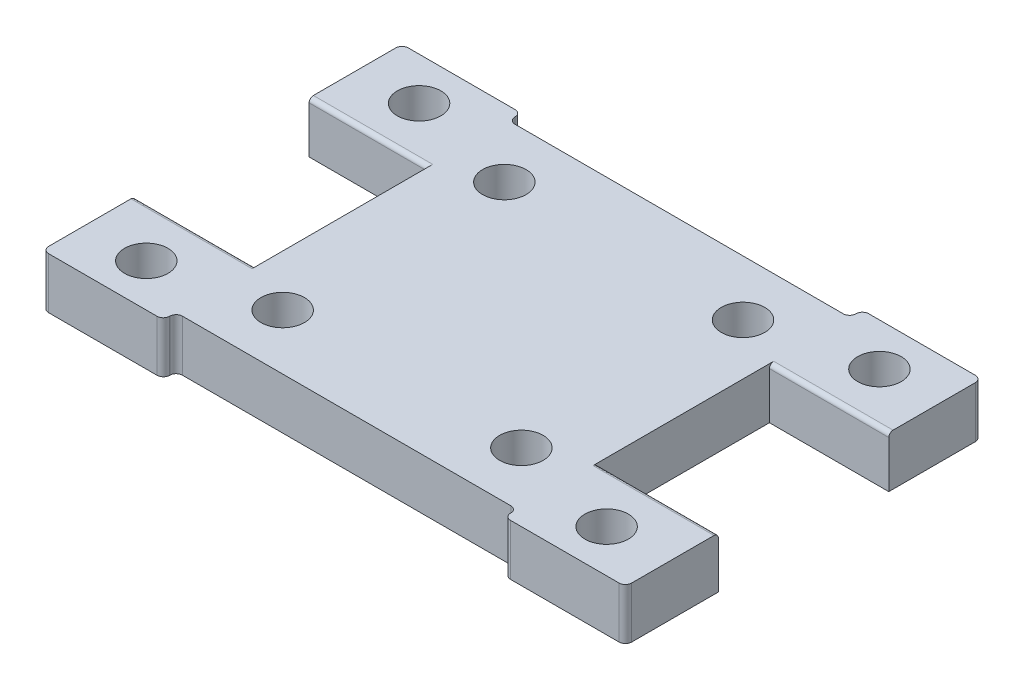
ISO-10303-21;
HEADER;
FILE_DESCRIPTION(('STEP AP214'),'2;1');
FILE_NAME('part.step','',(''),(''),'','','');
FILE_SCHEMA(('AUTOMOTIVE_DESIGN { 1 0 10303 214 1 1 1 1 }'));
ENDSEC;
DATA;
#1=APPLICATION_CONTEXT('core data for automotive mechanical design processes');
#2=APPLICATION_PROTOCOL_DEFINITION('international standard','automotive_design',2000,#1);
#3=PRODUCT_CONTEXT('',#1,'mechanical');
#4=PRODUCT('Part','Part','',(#3));
#5=PRODUCT_RELATED_PRODUCT_CATEGORY('part','',(#4));
#6=PRODUCT_DEFINITION_FORMATION('','',#4);
#7=PRODUCT_DEFINITION_CONTEXT('part definition',#1,'design');
#8=PRODUCT_DEFINITION('design','',#6,#7);
#9=PRODUCT_DEFINITION_SHAPE('','',#8);
#10=(LENGTH_UNIT() NAMED_UNIT(*) SI_UNIT(.MILLI.,.METRE.));
#11=(NAMED_UNIT(*) PLANE_ANGLE_UNIT() SI_UNIT($,.RADIAN.));
#12=(NAMED_UNIT(*) SI_UNIT($,.STERADIAN.) SOLID_ANGLE_UNIT());
#13=UNCERTAINTY_MEASURE_WITH_UNIT(LENGTH_MEASURE(1.E-05),#10,'distance_accuracy_value','');
#14=(GEOMETRIC_REPRESENTATION_CONTEXT(3) GLOBAL_UNCERTAINTY_ASSIGNED_CONTEXT((#13)) GLOBAL_UNIT_ASSIGNED_CONTEXT((#10,
#11,#12)) REPRESENTATION_CONTEXT('',''));
#15=CARTESIAN_POINT('',(0.,0.,0.));
#16=DIRECTION('',(0.,0.,1.));
#17=DIRECTION('',(1.,0.,0.));
#18=AXIS2_PLACEMENT_3D('',#15,#16,#17);
#19=CARTESIAN_POINT('',(20.74,6.,-20.26));
#20=DIRECTION('',(0.,-1.,0.));
#21=DIRECTION('',(0.,0.,-1.));
#22=AXIS2_PLACEMENT_3D('',#19,#20,#21);
#23=PLANE('',#22);
#24=DIRECTION('',(0.,0.,1.));
#25=VECTOR('',#24,1.);
#26=CARTESIAN_POINT('',(-34.,6.,-10.1));
#27=LINE('',#26,#25);
#28=CARTESIAN_POINT('',(-34.,6.,-20.26));
#29=VERTEX_POINT('',#28);
#30=CARTESIAN_POINT('',(-34.,6.,-10.6));
#31=VERTEX_POINT('',#30);
#32=EDGE_CURVE('E314',#29,#31,#27,.T.);
#33=ORIENTED_EDGE('',*,*,#32,.T.);
#34=DIRECTION('',(1.,0.,0.));
#35=VECTOR('',#34,1.);
#36=CARTESIAN_POINT('',(20.74,6.,-10.6));
#37=LINE('',#36,#35);
#38=CARTESIAN_POINT('',(-20.,6.,-10.6));
#39=VERTEX_POINT('',#38);
#40=EDGE_CURVE('E514',#31,#39,#37,.T.);
#41=ORIENTED_EDGE('',*,*,#40,.T.);
#42=DIRECTION('',(0.,0.,1.));
#43=VECTOR('',#42,1.);
#44=CARTESIAN_POINT('',(-20.,6.,10.0990098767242));
#45=LINE('',#44,#43);
#46=CARTESIAN_POINT('',(-20.,6.,10.5990098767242));
#47=VERTEX_POINT('',#46);
#48=EDGE_CURVE('E316',#39,#47,#45,.T.);
#49=ORIENTED_EDGE('',*,*,#48,.T.);
#50=DIRECTION('',(-1.,0.,0.));
#51=VECTOR('',#50,1.);
#52=CARTESIAN_POINT('',(20.74,6.,10.5990098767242));
#53=LINE('',#52,#51);
#54=CARTESIAN_POINT('',(-34.2,6.,10.5990098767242));
#55=VERTEX_POINT('',#54);
#56=EDGE_CURVE('E511',#47,#55,#53,.T.);
#57=ORIENTED_EDGE('',*,*,#56,.T.);
#58=DIRECTION('',(0.,0.,1.));
#59=VECTOR('',#58,1.);
#60=CARTESIAN_POINT('',(-34.2,6.,10.0990098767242));
#61=LINE('',#60,#59);
#62=CARTESIAN_POINT('',(-34.2,6.,20.26));
#63=VERTEX_POINT('',#62);
#64=EDGE_CURVE('E318',#55,#63,#61,.T.);
#65=ORIENTED_EDGE('',*,*,#64,.T.);
#66=CARTESIAN_POINT('',(-33.46,6.,20.26));
#67=DIRECTION('',(0.,-1.,0.));
#68=DIRECTION('',(0.,0.,-1.));
#69=AXIS2_PLACEMENT_3D('',#66,#67,#68);
#70=CIRCLE('',#69,0.74);
#71=CARTESIAN_POINT('',(-33.46,6.,21.));
#72=VERTEX_POINT('',#71);
#73=EDGE_CURVE('E485',#63,#72,#70,.F.);
#74=ORIENTED_EDGE('',*,*,#73,.T.);
#75=DIRECTION('',(1.,0.,0.));
#76=VECTOR('',#75,1.);
#77=CARTESIAN_POINT('',(-34.2,6.,21.));
#78=LINE('',#77,#76);
#79=CARTESIAN_POINT('',(-20.74,6.,21.));
#80=VERTEX_POINT('',#79);
#81=EDGE_CURVE('E320',#72,#80,#78,.T.);
#82=ORIENTED_EDGE('',*,*,#81,.T.);
#83=CARTESIAN_POINT('',(-20.74,6.,20.26));
#84=DIRECTION('',(0.,1.,0.));
#85=DIRECTION('',(0.,0.,-1.));
#86=AXIS2_PLACEMENT_3D('',#83,#84,#85);
#87=CIRCLE('',#86,0.739999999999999);
#88=CARTESIAN_POINT('',(-20.,6.,20.26));
#89=VERTEX_POINT('',#88);
#90=EDGE_CURVE('E322',#80,#89,#87,.T.);
#91=ORIENTED_EDGE('',*,*,#90,.T.);
#92=DIRECTION('',(0.,0.,-1.));
#93=VECTOR('',#92,1.);
#94=CARTESIAN_POINT('',(-20.,6.,20.26));
#95=LINE('',#94,#93);
#96=CARTESIAN_POINT('',(-20.,6.,20.24));
#97=VERTEX_POINT('',#96);
#98=EDGE_CURVE('E324',#89,#97,#95,.T.);
#99=ORIENTED_EDGE('',*,*,#98,.T.);
#100=CARTESIAN_POINT('',(-19.26,6.,20.24));
#101=DIRECTION('',(0.,-1.,0.));
#102=DIRECTION('',(0.,0.,1.));
#103=AXIS2_PLACEMENT_3D('',#100,#101,#102);
#104=CIRCLE('',#103,0.740000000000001);
#105=CARTESIAN_POINT('',(-19.26,6.,19.5));
#106=VERTEX_POINT('',#105);
#107=EDGE_CURVE('E326',#97,#106,#104,.T.);
#108=ORIENTED_EDGE('',*,*,#107,.T.);
#109=DIRECTION('',(1.,0.,0.));
#110=VECTOR('',#109,1.);
#111=CARTESIAN_POINT('',(-19.26,6.,19.5));
#112=LINE('',#111,#110);
#113=CARTESIAN_POINT('',(19.26,6.,19.5));
#114=VERTEX_POINT('',#113);
#115=EDGE_CURVE('E328',#106,#114,#112,.T.);
#116=ORIENTED_EDGE('',*,*,#115,.T.);
#117=CARTESIAN_POINT('',(19.26,6.,20.24));
#118=DIRECTION('',(0.,-1.,0.));
#119=DIRECTION('',(0.,0.,-1.));
#120=AXIS2_PLACEMENT_3D('',#117,#118,#119);
#121=CIRCLE('',#120,0.740000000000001);
#122=CARTESIAN_POINT('',(20.,6.,20.24));
#123=VERTEX_POINT('',#122);
#124=EDGE_CURVE('E330',#114,#123,#121,.T.);
#125=ORIENTED_EDGE('',*,*,#124,.T.);
#126=DIRECTION('',(0.,0.,1.));
#127=VECTOR('',#126,1.);
#128=CARTESIAN_POINT('',(20.,6.,20.26));
#129=LINE('',#128,#127);
#130=CARTESIAN_POINT('',(20.,6.,20.26));
#131=VERTEX_POINT('',#130);
#132=EDGE_CURVE('E332',#123,#131,#129,.T.);
#133=ORIENTED_EDGE('',*,*,#132,.T.);
#134=CARTESIAN_POINT('',(20.74,6.,20.26));
#135=DIRECTION('',(0.,1.,0.));
#136=DIRECTION('',(0.,0.,-1.));
#137=AXIS2_PLACEMENT_3D('',#134,#135,#136);
#138=CIRCLE('',#137,0.740000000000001);
#139=CARTESIAN_POINT('',(20.74,6.,21.));
#140=VERTEX_POINT('',#139);
#141=EDGE_CURVE('E334',#131,#140,#138,.T.);
#142=ORIENTED_EDGE('',*,*,#141,.T.);
#143=DIRECTION('',(1.,0.,0.));
#144=VECTOR('',#143,1.);
#145=CARTESIAN_POINT('',(34.2,6.,21.));
#146=LINE('',#145,#144);
#147=CARTESIAN_POINT('',(33.46,6.,21.));
#148=VERTEX_POINT('',#147);
#149=EDGE_CURVE('E336',#140,#148,#146,.T.);
#150=ORIENTED_EDGE('',*,*,#149,.T.);
#151=CARTESIAN_POINT('',(33.46,6.,20.26));
#152=DIRECTION('',(0.,-1.,0.));
#153=DIRECTION('',(0.,0.,-1.));
#154=AXIS2_PLACEMENT_3D('',#151,#152,#153);
#155=CIRCLE('',#154,0.74);
#156=CARTESIAN_POINT('',(34.2,6.,20.26));
#157=VERTEX_POINT('',#156);
#158=EDGE_CURVE('E483',#148,#157,#155,.F.);
#159=ORIENTED_EDGE('',*,*,#158,.T.);
#160=DIRECTION('',(0.,0.,-1.));
#161=VECTOR('',#160,1.);
#162=CARTESIAN_POINT('',(34.2,6.,10.0990098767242));
#163=LINE('',#162,#161);
#164=CARTESIAN_POINT('',(34.2,6.,10.5990098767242));
#165=VERTEX_POINT('',#164);
#166=EDGE_CURVE('E339',#157,#165,#163,.T.);
#167=ORIENTED_EDGE('',*,*,#166,.T.);
#168=DIRECTION('',(-1.,0.,0.));
#169=VECTOR('',#168,1.);
#170=CARTESIAN_POINT('',(20.74,6.,10.5990098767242));
#171=LINE('',#170,#169);
#172=CARTESIAN_POINT('',(20.,6.,10.5990098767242));
#173=VERTEX_POINT('',#172);
#174=EDGE_CURVE('E505',#165,#173,#171,.T.);
#175=ORIENTED_EDGE('',*,*,#174,.T.);
#176=DIRECTION('',(0.,0.,-1.));
#177=VECTOR('',#176,1.);
#178=CARTESIAN_POINT('',(20.,6.,10.0990098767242));
#179=LINE('',#178,#177);
#180=CARTESIAN_POINT('',(20.,6.,-10.6));
#181=VERTEX_POINT('',#180);
#182=EDGE_CURVE('E411',#173,#181,#179,.T.);
#183=ORIENTED_EDGE('',*,*,#182,.T.);
#184=DIRECTION('',(1.,0.,0.));
#185=VECTOR('',#184,1.);
#186=CARTESIAN_POINT('',(20.74,6.,-10.6));
#187=LINE('',#186,#185);
#188=CARTESIAN_POINT('',(34.,6.,-10.6));
#189=VERTEX_POINT('',#188);
#190=EDGE_CURVE('E508',#181,#189,#187,.T.);
#191=ORIENTED_EDGE('',*,*,#190,.T.);
#192=DIRECTION('',(0.,0.,-1.));
#193=VECTOR('',#192,1.);
#194=CARTESIAN_POINT('',(34.,6.,-10.1));
#195=LINE('',#194,#193);
#196=CARTESIAN_POINT('',(34.,6.,-20.26));
#197=VERTEX_POINT('',#196);
#198=EDGE_CURVE('E281',#189,#197,#195,.T.);
#199=ORIENTED_EDGE('',*,*,#198,.T.);
#200=CARTESIAN_POINT('',(33.26,6.,-20.26));
#201=DIRECTION('',(0.,-1.,0.));
#202=DIRECTION('',(0.,0.,-1.));
#203=AXIS2_PLACEMENT_3D('',#200,#201,#202);
#204=CIRCLE('',#203,0.74);
#205=CARTESIAN_POINT('',(33.26,6.,-21.));
#206=VERTEX_POINT('',#205);
#207=EDGE_CURVE('E277',#197,#206,#204,.F.);
#208=ORIENTED_EDGE('',*,*,#207,.T.);
#209=DIRECTION('',(-1.,0.,0.));
#210=VECTOR('',#209,1.);
#211=CARTESIAN_POINT('',(20.74,6.,-21.));
#212=LINE('',#211,#210);
#213=CARTESIAN_POINT('',(20.74,6.,-21.));
#214=VERTEX_POINT('',#213);
#215=EDGE_CURVE('E269',#206,#214,#212,.T.);
#216=ORIENTED_EDGE('',*,*,#215,.T.);
#217=CARTESIAN_POINT('',(20.74,6.,-20.26));
#218=DIRECTION('',(0.,1.,0.));
#219=DIRECTION('',(0.,0.,-1.));
#220=AXIS2_PLACEMENT_3D('',#217,#218,#219);
#221=CIRCLE('',#220,0.740000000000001);
#222=CARTESIAN_POINT('',(20.,6.,-20.26));
#223=VERTEX_POINT('',#222);
#224=EDGE_CURVE('E274',#214,#223,#221,.T.);
#225=ORIENTED_EDGE('',*,*,#224,.T.);
#226=DIRECTION('',(0.,0.,1.));
#227=VECTOR('',#226,1.);
#228=CARTESIAN_POINT('',(20.,6.,-20.24));
#229=LINE('',#228,#227);
#230=CARTESIAN_POINT('',(20.,6.,-20.24));
#231=VERTEX_POINT('',#230);
#232=EDGE_CURVE('E296',#223,#231,#229,.T.);
#233=ORIENTED_EDGE('',*,*,#232,.T.);
#234=CARTESIAN_POINT('',(19.26,6.,-20.24));
#235=DIRECTION('',(0.,-1.,0.));
#236=DIRECTION('',(0.,0.,1.));
#237=AXIS2_PLACEMENT_3D('',#234,#235,#236);
#238=CIRCLE('',#237,0.740000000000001);
#239=CARTESIAN_POINT('',(19.26,6.,-19.5));
#240=VERTEX_POINT('',#239);
#241=EDGE_CURVE('E298',#231,#240,#238,.T.);
#242=ORIENTED_EDGE('',*,*,#241,.T.);
#243=DIRECTION('',(-1.,0.,0.));
#244=VECTOR('',#243,1.);
#245=CARTESIAN_POINT('',(-19.26,6.,-19.5));
#246=LINE('',#245,#244);
#247=CARTESIAN_POINT('',(-19.26,6.,-19.5));
#248=VERTEX_POINT('',#247);
#249=EDGE_CURVE('E303',#240,#248,#246,.T.);
#250=ORIENTED_EDGE('',*,*,#249,.T.);
#251=CARTESIAN_POINT('',(-19.26,6.,-20.24));
#252=DIRECTION('',(0.,-1.,0.));
#253=DIRECTION('',(0.,0.,1.));
#254=AXIS2_PLACEMENT_3D('',#251,#252,#253);
#255=CIRCLE('',#254,0.740000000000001);
#256=CARTESIAN_POINT('',(-20.,6.,-20.24));
#257=VERTEX_POINT('',#256);
#258=EDGE_CURVE('E305',#248,#257,#255,.T.);
#259=ORIENTED_EDGE('',*,*,#258,.T.);
#260=DIRECTION('',(0.,0.,-1.));
#261=VECTOR('',#260,1.);
#262=CARTESIAN_POINT('',(-20.,6.,-20.24));
#263=LINE('',#262,#261);
#264=CARTESIAN_POINT('',(-20.,6.,-20.26));
#265=VERTEX_POINT('',#264);
#266=EDGE_CURVE('E307',#257,#265,#263,.T.);
#267=ORIENTED_EDGE('',*,*,#266,.T.);
#268=CARTESIAN_POINT('',(-20.74,6.,-20.26));
#269=DIRECTION('',(0.,1.,0.));
#270=DIRECTION('',(0.,0.,-1.));
#271=AXIS2_PLACEMENT_3D('',#268,#269,#270);
#272=CIRCLE('',#271,0.740000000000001);
#273=CARTESIAN_POINT('',(-20.74,6.,-21.));
#274=VERTEX_POINT('',#273);
#275=EDGE_CURVE('E309',#265,#274,#272,.T.);
#276=ORIENTED_EDGE('',*,*,#275,.T.);
#277=DIRECTION('',(-1.,0.,0.));
#278=VECTOR('',#277,1.);
#279=CARTESIAN_POINT('',(-20.74,6.,-21.));
#280=LINE('',#279,#278);
#281=CARTESIAN_POINT('',(-33.26,6.,-21.));
#282=VERTEX_POINT('',#281);
#283=EDGE_CURVE('E311',#274,#282,#280,.T.);
#284=ORIENTED_EDGE('',*,*,#283,.T.);
#285=CARTESIAN_POINT('',(-33.26,6.,-20.26));
#286=DIRECTION('',(0.,-1.,0.));
#287=DIRECTION('',(0.,0.,-1.));
#288=AXIS2_PLACEMENT_3D('',#285,#286,#287);
#289=CIRCLE('',#288,0.74);
#290=EDGE_CURVE('E487',#282,#29,#289,.F.);
#291=ORIENTED_EDGE('',*,*,#290,.T.);
#292=EDGE_LOOP('',(#33,#41,#49,#57,#65,#74,#82,#91,#99,#108,#116,#125,#133,#142,#150,#159,#167,
#175,#183,#191,#199,#208,#216,#225,#233,#242,#250,#259,#267,#276,#284,#291));
#293=FACE_BOUND('',#292,.T.);
#294=CARTESIAN_POINT('',(-14.,6.,-13.));
#295=DIRECTION('',(0.,1.,0.));
#296=DIRECTION('',(0.,0.,1.));
#297=AXIS2_PLACEMENT_3D('',#294,#295,#296);
#298=CIRCLE('',#297,2.55);
#299=CARTESIAN_POINT('',(-14.,6.,-10.45));
#300=VERTEX_POINT('',#299);
#301=EDGE_CURVE('E347',#300,#300,#298,.T.);
#302=ORIENTED_EDGE('',*,*,#301,.F.);
#303=EDGE_LOOP('',(#302));
#304=FACE_BOUND('',#303,.T.);
#305=CARTESIAN_POINT('',(27.,6.,-16.));
#306=DIRECTION('',(0.,1.,0.));
#307=DIRECTION('',(0.,0.,1.));
#308=AXIS2_PLACEMENT_3D('',#305,#306,#307);
#309=CIRCLE('',#308,2.55);
#310=CARTESIAN_POINT('',(27.,6.,-13.45));
#311=VERTEX_POINT('',#310);
#312=EDGE_CURVE('E554',#311,#311,#309,.T.);
#313=ORIENTED_EDGE('',*,*,#312,.F.);
#314=EDGE_LOOP('',(#313));
#315=FACE_BOUND('',#314,.T.);
#316=CARTESIAN_POINT('',(14.,6.,-13.));
#317=DIRECTION('',(0.,1.,0.));
#318=DIRECTION('',(0.,0.,-1.));
#319=AXIS2_PLACEMENT_3D('',#316,#317,#318);
#320=CIRCLE('',#319,2.55);
#321=CARTESIAN_POINT('',(14.,6.,-15.55));
#322=VERTEX_POINT('',#321);
#323=EDGE_CURVE('E560',#322,#322,#320,.T.);
#324=ORIENTED_EDGE('',*,*,#323,.F.);
#325=EDGE_LOOP('',(#324));
#326=FACE_BOUND('',#325,.T.);
#327=CARTESIAN_POINT('',(14.,6.,13.));
#328=DIRECTION('',(0.,1.,0.));
#329=DIRECTION('',(0.,0.,1.));
#330=AXIS2_PLACEMENT_3D('',#327,#328,#329);
#331=CIRCLE('',#330,2.55);
#332=CARTESIAN_POINT('',(14.,6.,15.55));
#333=VERTEX_POINT('',#332);
#334=EDGE_CURVE('E566',#333,#333,#331,.T.);
#335=ORIENTED_EDGE('',*,*,#334,.F.);
#336=EDGE_LOOP('',(#335));
#337=FACE_BOUND('',#336,.T.);
#338=CARTESIAN_POINT('',(-14.,6.,13.));
#339=DIRECTION('',(0.,1.,0.));
#340=DIRECTION('',(0.,0.,-1.));
#341=AXIS2_PLACEMENT_3D('',#338,#339,#340);
#342=CIRCLE('',#341,2.55);
#343=CARTESIAN_POINT('',(-14.,6.,10.45));
#344=VERTEX_POINT('',#343);
#345=EDGE_CURVE('E572',#344,#344,#342,.T.);
#346=ORIENTED_EDGE('',*,*,#345,.F.);
#347=EDGE_LOOP('',(#346));
#348=FACE_BOUND('',#347,.T.);
#349=CARTESIAN_POINT('',(27.,6.,16.));
#350=DIRECTION('',(0.,1.,0.));
#351=DIRECTION('',(0.,0.,-1.));
#352=AXIS2_PLACEMENT_3D('',#349,#350,#351);
#353=CIRCLE('',#352,2.55);
#354=CARTESIAN_POINT('',(27.,6.,13.45));
#355=VERTEX_POINT('',#354);
#356=EDGE_CURVE('E578',#355,#355,#353,.T.);
#357=ORIENTED_EDGE('',*,*,#356,.F.);
#358=EDGE_LOOP('',(#357));
#359=FACE_BOUND('',#358,.T.);
#360=CARTESIAN_POINT('',(-27.,6.,16.));
#361=DIRECTION('',(0.,1.,0.));
#362=DIRECTION('',(0.,0.,1.));
#363=AXIS2_PLACEMENT_3D('',#360,#361,#362);
#364=CIRCLE('',#363,2.55);
#365=CARTESIAN_POINT('',(-27.,6.,18.55));
#366=VERTEX_POINT('',#365);
#367=EDGE_CURVE('E584',#366,#366,#364,.T.);
#368=ORIENTED_EDGE('',*,*,#367,.F.);
#369=EDGE_LOOP('',(#368));
#370=FACE_BOUND('',#369,.T.);
#371=CARTESIAN_POINT('',(-27.,6.,-16.));
#372=DIRECTION('',(0.,1.,0.));
#373=DIRECTION('',(0.,0.,-1.));
#374=AXIS2_PLACEMENT_3D('',#371,#372,#373);
#375=CIRCLE('',#374,2.55);
#376=CARTESIAN_POINT('',(-27.,6.,-18.55));
#377=VERTEX_POINT('',#376);
#378=EDGE_CURVE('E590',#377,#377,#375,.T.);
#379=ORIENTED_EDGE('',*,*,#378,.F.);
#380=EDGE_LOOP('',(#379));
#381=FACE_BOUND('',#380,.T.);
#382=ADVANCED_FACE('F39',(#293,#304,#315,#326,#337,#348,#359,#370,#381),#23,.F.);
#383=CARTESIAN_POINT('',(20.74,0.,-20.26));
#384=DIRECTION('',(0.,-1.,0.));
#385=DIRECTION('',(0.,0.,-1.));
#386=AXIS2_PLACEMENT_3D('',#383,#384,#385);
#387=PLANE('',#386);
#388=CARTESIAN_POINT('',(-27.,0.,16.));
#389=DIRECTION('',(0.,1.,0.));
#390=DIRECTION('',(0.,0.,1.));
#391=AXIS2_PLACEMENT_3D('',#388,#389,#390);
#392=CIRCLE('',#391,2.55);
#393=CARTESIAN_POINT('',(-27.,0.,18.55));
#394=VERTEX_POINT('',#393);
#395=EDGE_CURVE('E587',#394,#394,#392,.T.);
#396=ORIENTED_EDGE('',*,*,#395,.T.);
#397=EDGE_LOOP('',(#396));
#398=FACE_BOUND('',#397,.T.);
#399=CARTESIAN_POINT('',(-14.,0.,13.));
#400=DIRECTION('',(0.,1.,0.));
#401=DIRECTION('',(0.,0.,-1.));
#402=AXIS2_PLACEMENT_3D('',#399,#400,#401);
#403=CIRCLE('',#402,2.55);
#404=CARTESIAN_POINT('',(-14.,0.,10.45));
#405=VERTEX_POINT('',#404);
#406=EDGE_CURVE('E575',#405,#405,#403,.T.);
#407=ORIENTED_EDGE('',*,*,#406,.T.);
#408=EDGE_LOOP('',(#407));
#409=FACE_BOUND('',#408,.T.);
#410=CARTESIAN_POINT('',(14.,0.,-13.));
#411=DIRECTION('',(0.,1.,0.));
#412=DIRECTION('',(0.,0.,-1.));
#413=AXIS2_PLACEMENT_3D('',#410,#411,#412);
#414=CIRCLE('',#413,2.55);
#415=CARTESIAN_POINT('',(14.,0.,-15.55));
#416=VERTEX_POINT('',#415);
#417=EDGE_CURVE('E563',#416,#416,#414,.T.);
#418=ORIENTED_EDGE('',*,*,#417,.T.);
#419=EDGE_LOOP('',(#418));
#420=FACE_BOUND('',#419,.T.);
#421=CARTESIAN_POINT('',(-14.,0.,-13.));
#422=DIRECTION('',(0.,1.,0.));
#423=DIRECTION('',(0.,0.,1.));
#424=AXIS2_PLACEMENT_3D('',#421,#422,#423);
#425=CIRCLE('',#424,2.55);
#426=CARTESIAN_POINT('',(-14.,0.,-10.45));
#427=VERTEX_POINT('',#426);
#428=EDGE_CURVE('E551',#427,#427,#425,.T.);
#429=ORIENTED_EDGE('',*,*,#428,.T.);
#430=EDGE_LOOP('',(#429));
#431=FACE_BOUND('',#430,.T.);
#432=DIRECTION('',(0.,0.,1.));
#433=VECTOR('',#432,1.);
#434=CARTESIAN_POINT('',(-34.,0.,-10.1));
#435=LINE('',#434,#433);
#436=CARTESIAN_POINT('',(-34.,0.,-20.26));
#437=VERTEX_POINT('',#436);
#438=CARTESIAN_POINT('',(-34.,0.,-10.1));
#439=VERTEX_POINT('',#438);
#440=EDGE_CURVE('E371',#437,#439,#435,.T.);
#441=ORIENTED_EDGE('',*,*,#440,.F.);
#442=CARTESIAN_POINT('',(-33.26,0.,-20.26));
#443=DIRECTION('',(0.,-1.,0.));
#444=DIRECTION('',(0.,0.,-1.));
#445=AXIS2_PLACEMENT_3D('',#442,#443,#444);
#446=CIRCLE('',#445,0.74);
#447=CARTESIAN_POINT('',(-33.26,0.,-21.));
#448=VERTEX_POINT('',#447);
#449=EDGE_CURVE('E478',#437,#448,#446,.T.);
#450=ORIENTED_EDGE('',*,*,#449,.T.);
#451=DIRECTION('',(-1.,0.,0.));
#452=VECTOR('',#451,1.);
#453=CARTESIAN_POINT('',(-20.74,0.,-21.));
#454=LINE('',#453,#452);
#455=CARTESIAN_POINT('',(-20.74,0.,-21.));
#456=VERTEX_POINT('',#455);
#457=EDGE_CURVE('E368',#456,#448,#454,.T.);
#458=ORIENTED_EDGE('',*,*,#457,.F.);
#459=CARTESIAN_POINT('',(-20.74,0.,-20.26));
#460=DIRECTION('',(0.,1.,0.));
#461=DIRECTION('',(0.,0.,-1.));
#462=AXIS2_PLACEMENT_3D('',#459,#460,#461);
#463=CIRCLE('',#462,0.740000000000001);
#464=CARTESIAN_POINT('',(-20.,0.,-20.26));
#465=VERTEX_POINT('',#464);
#466=EDGE_CURVE('E366',#465,#456,#463,.T.);
#467=ORIENTED_EDGE('',*,*,#466,.F.);
#468=DIRECTION('',(0.,0.,-1.));
#469=VECTOR('',#468,1.);
#470=CARTESIAN_POINT('',(-20.,0.,-20.24));
#471=LINE('',#470,#469);
#472=CARTESIAN_POINT('',(-20.,0.,-20.24));
#473=VERTEX_POINT('',#472);
#474=EDGE_CURVE('E364',#473,#465,#471,.T.);
#475=ORIENTED_EDGE('',*,*,#474,.F.);
#476=CARTESIAN_POINT('',(-19.26,0.,-20.24));
#477=DIRECTION('',(0.,-1.,0.));
#478=DIRECTION('',(0.,0.,1.));
#479=AXIS2_PLACEMENT_3D('',#476,#477,#478);
#480=CIRCLE('',#479,0.740000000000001);
#481=CARTESIAN_POINT('',(-19.26,0.,-19.5));
#482=VERTEX_POINT('',#481);
#483=EDGE_CURVE('E362',#482,#473,#480,.T.);
#484=ORIENTED_EDGE('',*,*,#483,.F.);
#485=DIRECTION('',(-1.,0.,0.));
#486=VECTOR('',#485,1.);
#487=CARTESIAN_POINT('',(-19.26,0.,-19.5));
#488=LINE('',#487,#486);
#489=CARTESIAN_POINT('',(19.26,0.,-19.5));
#490=VERTEX_POINT('',#489);
#491=EDGE_CURVE('E360',#490,#482,#488,.T.);
#492=ORIENTED_EDGE('',*,*,#491,.F.);
#493=CARTESIAN_POINT('',(19.26,0.,-20.24));
#494=DIRECTION('',(0.,-1.,0.));
#495=DIRECTION('',(0.,0.,1.));
#496=AXIS2_PLACEMENT_3D('',#493,#494,#495);
#497=CIRCLE('',#496,0.740000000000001);
#498=CARTESIAN_POINT('',(20.,0.,-20.24));
#499=VERTEX_POINT('',#498);
#500=EDGE_CURVE('E358',#499,#490,#497,.T.);
#501=ORIENTED_EDGE('',*,*,#500,.F.);
#502=DIRECTION('',(0.,0.,1.));
#503=VECTOR('',#502,1.);
#504=CARTESIAN_POINT('',(20.,0.,-20.24));
#505=LINE('',#504,#503);
#506=CARTESIAN_POINT('',(20.,0.,-20.26));
#507=VERTEX_POINT('',#506);
#508=EDGE_CURVE('E356',#507,#499,#505,.T.);
#509=ORIENTED_EDGE('',*,*,#508,.F.);
#510=CARTESIAN_POINT('',(20.74,0.,-20.26));
#511=DIRECTION('',(0.,1.,0.));
#512=DIRECTION('',(0.,0.,-1.));
#513=AXIS2_PLACEMENT_3D('',#510,#511,#512);
#514=CIRCLE('',#513,0.740000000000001);
#515=CARTESIAN_POINT('',(20.74,0.,-21.));
#516=VERTEX_POINT('',#515);
#517=EDGE_CURVE('E354',#516,#507,#514,.T.);
#518=ORIENTED_EDGE('',*,*,#517,.F.);
#519=DIRECTION('',(-1.,0.,0.));
#520=VECTOR('',#519,1.);
#521=CARTESIAN_POINT('',(20.74,0.,-21.));
#522=LINE('',#521,#520);
#523=CARTESIAN_POINT('',(33.26,0.,-21.));
#524=VERTEX_POINT('',#523);
#525=EDGE_CURVE('E287',#524,#516,#522,.T.);
#526=ORIENTED_EDGE('',*,*,#525,.F.);
#527=CARTESIAN_POINT('',(33.26,0.,-20.26));
#528=DIRECTION('',(0.,-1.,0.));
#529=DIRECTION('',(0.,0.,-1.));
#530=AXIS2_PLACEMENT_3D('',#527,#528,#529);
#531=CIRCLE('',#530,0.74);
#532=CARTESIAN_POINT('',(34.,0.,-20.26));
#533=VERTEX_POINT('',#532);
#534=EDGE_CURVE('E472',#524,#533,#531,.T.);
#535=ORIENTED_EDGE('',*,*,#534,.T.);
#536=DIRECTION('',(0.,0.,-1.));
#537=VECTOR('',#536,1.);
#538=CARTESIAN_POINT('',(34.,0.,-10.1));
#539=LINE('',#538,#537);
#540=CARTESIAN_POINT('',(34.,0.,-10.1));
#541=VERTEX_POINT('',#540);
#542=EDGE_CURVE('E350',#541,#533,#539,.T.);
#543=ORIENTED_EDGE('',*,*,#542,.F.);
#544=DIRECTION('',(1.,0.,0.));
#545=VECTOR('',#544,1.);
#546=CARTESIAN_POINT('',(20.,0.,-10.1));
#547=LINE('',#546,#545);
#548=CARTESIAN_POINT('',(20.,0.,-10.1));
#549=VERTEX_POINT('',#548);
#550=EDGE_CURVE('E346',#549,#541,#547,.T.);
#551=ORIENTED_EDGE('',*,*,#550,.F.);
#552=DIRECTION('',(0.,0.,-1.));
#553=VECTOR('',#552,1.);
#554=CARTESIAN_POINT('',(20.,0.,10.0990098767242));
#555=LINE('',#554,#553);
#556=CARTESIAN_POINT('',(20.,0.,10.0990098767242));
#557=VERTEX_POINT('',#556);
#558=EDGE_CURVE('E343',#557,#549,#555,.T.);
#559=ORIENTED_EDGE('',*,*,#558,.F.);
#560=DIRECTION('',(-1.,0.,0.));
#561=VECTOR('',#560,1.);
#562=CARTESIAN_POINT('',(34.2,0.,10.0990098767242));
#563=LINE('',#562,#561);
#564=CARTESIAN_POINT('',(34.2,0.,10.0990098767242));
#565=VERTEX_POINT('',#564);
#566=EDGE_CURVE('E408',#565,#557,#563,.T.);
#567=ORIENTED_EDGE('',*,*,#566,.F.);
#568=DIRECTION('',(0.,0.,-1.));
#569=VECTOR('',#568,1.);
#570=CARTESIAN_POINT('',(34.2,0.,10.0990098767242));
#571=LINE('',#570,#569);
#572=CARTESIAN_POINT('',(34.2,0.,20.26));
#573=VERTEX_POINT('',#572);
#574=EDGE_CURVE('E405',#573,#565,#571,.T.);
#575=ORIENTED_EDGE('',*,*,#574,.F.);
#576=CARTESIAN_POINT('',(33.46,0.,20.26));
#577=DIRECTION('',(0.,-1.,0.));
#578=DIRECTION('',(0.,0.,-1.));
#579=AXIS2_PLACEMENT_3D('',#576,#577,#578);
#580=CIRCLE('',#579,0.74);
#581=CARTESIAN_POINT('',(33.46,0.,21.));
#582=VERTEX_POINT('',#581);
#583=EDGE_CURVE('E474',#573,#582,#580,.T.);
#584=ORIENTED_EDGE('',*,*,#583,.T.);
#585=DIRECTION('',(1.,0.,0.));
#586=VECTOR('',#585,1.);
#587=CARTESIAN_POINT('',(34.2,0.,21.));
#588=LINE('',#587,#586);
#589=CARTESIAN_POINT('',(20.74,0.,21.));
#590=VERTEX_POINT('',#589);
#591=EDGE_CURVE('E402',#590,#582,#588,.T.);
#592=ORIENTED_EDGE('',*,*,#591,.F.);
#593=CARTESIAN_POINT('',(20.74,0.,20.26));
#594=DIRECTION('',(0.,1.,0.));
#595=DIRECTION('',(0.,0.,-1.));
#596=AXIS2_PLACEMENT_3D('',#593,#594,#595);
#597=CIRCLE('',#596,0.740000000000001);
#598=CARTESIAN_POINT('',(20.,0.,20.26));
#599=VERTEX_POINT('',#598);
#600=EDGE_CURVE('E400',#599,#590,#597,.T.);
#601=ORIENTED_EDGE('',*,*,#600,.F.);
#602=DIRECTION('',(0.,0.,1.));
#603=VECTOR('',#602,1.);
#604=CARTESIAN_POINT('',(20.,0.,20.26));
#605=LINE('',#604,#603);
#606=CARTESIAN_POINT('',(20.,0.,20.24));
#607=VERTEX_POINT('',#606);
#608=EDGE_CURVE('E398',#607,#599,#605,.T.);
#609=ORIENTED_EDGE('',*,*,#608,.F.);
#610=CARTESIAN_POINT('',(19.26,0.,20.24));
#611=DIRECTION('',(0.,-1.,0.));
#612=DIRECTION('',(0.,0.,-1.));
#613=AXIS2_PLACEMENT_3D('',#610,#611,#612);
#614=CIRCLE('',#613,0.740000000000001);
#615=CARTESIAN_POINT('',(19.26,0.,19.5));
#616=VERTEX_POINT('',#615);
#617=EDGE_CURVE('E396',#616,#607,#614,.T.);
#618=ORIENTED_EDGE('',*,*,#617,.F.);
#619=DIRECTION('',(1.,0.,0.));
#620=VECTOR('',#619,1.);
#621=CARTESIAN_POINT('',(-19.26,0.,19.5));
#622=LINE('',#621,#620);
#623=CARTESIAN_POINT('',(-19.26,0.,19.5));
#624=VERTEX_POINT('',#623);
#625=EDGE_CURVE('E394',#624,#616,#622,.T.);
#626=ORIENTED_EDGE('',*,*,#625,.F.);
#627=CARTESIAN_POINT('',(-19.26,0.,20.24));
#628=DIRECTION('',(0.,-1.,0.));
#629=DIRECTION('',(0.,0.,1.));
#630=AXIS2_PLACEMENT_3D('',#627,#628,#629);
#631=CIRCLE('',#630,0.740000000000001);
#632=CARTESIAN_POINT('',(-20.,0.,20.24));
#633=VERTEX_POINT('',#632);
#634=EDGE_CURVE('E392',#633,#624,#631,.T.);
#635=ORIENTED_EDGE('',*,*,#634,.F.);
#636=DIRECTION('',(0.,0.,-1.));
#637=VECTOR('',#636,1.);
#638=CARTESIAN_POINT('',(-20.,0.,20.26));
#639=LINE('',#638,#637);
#640=CARTESIAN_POINT('',(-20.,0.,20.26));
#641=VERTEX_POINT('',#640);
#642=EDGE_CURVE('E390',#641,#633,#639,.T.);
#643=ORIENTED_EDGE('',*,*,#642,.F.);
#644=CARTESIAN_POINT('',(-20.74,0.,20.26));
#645=DIRECTION('',(0.,1.,0.));
#646=DIRECTION('',(0.,0.,-1.));
#647=AXIS2_PLACEMENT_3D('',#644,#645,#646);
#648=CIRCLE('',#647,0.739999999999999);
#649=CARTESIAN_POINT('',(-20.74,0.,21.));
#650=VERTEX_POINT('',#649);
#651=EDGE_CURVE('E388',#650,#641,#648,.T.);
#652=ORIENTED_EDGE('',*,*,#651,.F.);
#653=DIRECTION('',(1.,0.,0.));
#654=VECTOR('',#653,1.);
#655=CARTESIAN_POINT('',(-34.2,0.,21.));
#656=LINE('',#655,#654);
#657=CARTESIAN_POINT('',(-33.46,0.,21.));
#658=VERTEX_POINT('',#657);
#659=EDGE_CURVE('E386',#658,#650,#656,.T.);
#660=ORIENTED_EDGE('',*,*,#659,.F.);
#661=CARTESIAN_POINT('',(-33.46,0.,20.26));
#662=DIRECTION('',(0.,-1.,0.));
#663=DIRECTION('',(0.,0.,-1.));
#664=AXIS2_PLACEMENT_3D('',#661,#662,#663);
#665=CIRCLE('',#664,0.74);
#666=CARTESIAN_POINT('',(-34.2,0.,20.26));
#667=VERTEX_POINT('',#666);
#668=EDGE_CURVE('E476',#658,#667,#665,.T.);
#669=ORIENTED_EDGE('',*,*,#668,.T.);
#670=DIRECTION('',(0.,0.,1.));
#671=VECTOR('',#670,1.);
#672=CARTESIAN_POINT('',(-34.2,0.,10.0990098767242));
#673=LINE('',#672,#671);
#674=CARTESIAN_POINT('',(-34.2,0.,10.0990098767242));
#675=VERTEX_POINT('',#674);
#676=EDGE_CURVE('E383',#675,#667,#673,.T.);
#677=ORIENTED_EDGE('',*,*,#676,.F.);
#678=DIRECTION('',(-1.,0.,0.));
#679=VECTOR('',#678,1.);
#680=CARTESIAN_POINT('',(-34.2,0.,10.0990098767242));
#681=LINE('',#680,#679);
#682=CARTESIAN_POINT('',(-20.,0.,10.0990098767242));
#683=VERTEX_POINT('',#682);
#684=EDGE_CURVE('E380',#683,#675,#681,.T.);
#685=ORIENTED_EDGE('',*,*,#684,.F.);
#686=DIRECTION('',(0.,0.,1.));
#687=VECTOR('',#686,1.);
#688=CARTESIAN_POINT('',(-20.,0.,10.0990098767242));
#689=LINE('',#688,#687);
#690=CARTESIAN_POINT('',(-20.,0.,-10.1));
#691=VERTEX_POINT('',#690);
#692=EDGE_CURVE('E377',#691,#683,#689,.T.);
#693=ORIENTED_EDGE('',*,*,#692,.F.);
#694=DIRECTION('',(1.,0.,0.));
#695=VECTOR('',#694,1.);
#696=CARTESIAN_POINT('',(-20.,0.,-10.1));
#697=LINE('',#696,#695);
#698=EDGE_CURVE('E374',#439,#691,#697,.T.);
#699=ORIENTED_EDGE('',*,*,#698,.F.);
#700=EDGE_LOOP('',(#441,#450,#458,#467,#475,#484,#492,#501,#509,#518,#526,#535,#543,#551,#559,
#567,#575,#584,#592,#601,#609,#618,#626,#635,#643,#652,#660,#669,#677,#685,#693,#699));
#701=FACE_BOUND('',#700,.T.);
#702=CARTESIAN_POINT('',(27.,0.,-16.));
#703=DIRECTION('',(0.,1.,0.));
#704=DIRECTION('',(0.,0.,1.));
#705=AXIS2_PLACEMENT_3D('',#702,#703,#704);
#706=CIRCLE('',#705,2.55);
#707=CARTESIAN_POINT('',(27.,0.,-13.45));
#708=VERTEX_POINT('',#707);
#709=EDGE_CURVE('E557',#708,#708,#706,.T.);
#710=ORIENTED_EDGE('',*,*,#709,.T.);
#711=EDGE_LOOP('',(#710));
#712=FACE_BOUND('',#711,.T.);
#713=CARTESIAN_POINT('',(14.,0.,13.));
#714=DIRECTION('',(0.,1.,0.));
#715=DIRECTION('',(0.,0.,1.));
#716=AXIS2_PLACEMENT_3D('',#713,#714,#715);
#717=CIRCLE('',#716,2.55);
#718=CARTESIAN_POINT('',(14.,0.,15.55));
#719=VERTEX_POINT('',#718);
#720=EDGE_CURVE('E569',#719,#719,#717,.T.);
#721=ORIENTED_EDGE('',*,*,#720,.T.);
#722=EDGE_LOOP('',(#721));
#723=FACE_BOUND('',#722,.T.);
#724=CARTESIAN_POINT('',(27.,0.,16.));
#725=DIRECTION('',(0.,1.,0.));
#726=DIRECTION('',(0.,0.,-1.));
#727=AXIS2_PLACEMENT_3D('',#724,#725,#726);
#728=CIRCLE('',#727,2.55);
#729=CARTESIAN_POINT('',(27.,0.,13.45));
#730=VERTEX_POINT('',#729);
#731=EDGE_CURVE('E581',#730,#730,#728,.T.);
#732=ORIENTED_EDGE('',*,*,#731,.T.);
#733=EDGE_LOOP('',(#732));
#734=FACE_BOUND('',#733,.T.);
#735=CARTESIAN_POINT('',(-27.,0.,-16.));
#736=DIRECTION('',(0.,1.,0.));
#737=DIRECTION('',(0.,0.,-1.));
#738=AXIS2_PLACEMENT_3D('',#735,#736,#737);
#739=CIRCLE('',#738,2.55);
#740=CARTESIAN_POINT('',(-27.,0.,-18.55));
#741=VERTEX_POINT('',#740);
#742=EDGE_CURVE('E593',#741,#741,#739,.T.);
#743=ORIENTED_EDGE('',*,*,#742,.T.);
#744=EDGE_LOOP('',(#743));
#745=FACE_BOUND('',#744,.T.);
#746=ADVANCED_FACE('F603',(#398,#409,#420,#431,#701,#712,#723,#734,#745),#387,.T.);
#747=CARTESIAN_POINT('',(20.,6.,10.0990098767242));
#748=DIRECTION('',(-1.,0.,0.));
#749=DIRECTION('',(0.,0.,1.));
#750=AXIS2_PLACEMENT_3D('',#747,#748,#749);
#751=PLANE('',#750);
#752=ORIENTED_EDGE('',*,*,#558,.T.);
#753=DIRECTION('',(0.,-1.,0.));
#754=VECTOR('',#753,1.);
#755=CARTESIAN_POINT('',(20.,6.,-10.1));
#756=LINE('',#755,#754);
#757=CARTESIAN_POINT('',(20.,5.5,-10.1));
#758=VERTEX_POINT('',#757);
#759=EDGE_CURVE('E467',#758,#549,#756,.T.);
#760=ORIENTED_EDGE('',*,*,#759,.F.);
#761=CARTESIAN_POINT('',(20.,5.5,-10.6));
#762=DIRECTION('',(-1.,0.,0.));
#763=DIRECTION('',(0.,0.,1.));
#764=AXIS2_PLACEMENT_3D('',#761,#762,#763);
#765=CIRCLE('',#764,0.5);
#766=EDGE_CURVE('E47',#758,#181,#765,.T.);
#767=ORIENTED_EDGE('',*,*,#766,.T.);
#768=ORIENTED_EDGE('',*,*,#182,.F.);
#769=CARTESIAN_POINT('',(20.,5.5,10.5990098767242));
#770=DIRECTION('',(-1.,0.,0.));
#771=DIRECTION('',(0.,0.,1.));
#772=AXIS2_PLACEMENT_3D('',#769,#770,#771);
#773=CIRCLE('',#772,0.5);
#774=CARTESIAN_POINT('',(20.,5.5,10.0990098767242));
#775=VERTEX_POINT('',#774);
#776=EDGE_CURVE('E11',#173,#775,#773,.T.);
#777=ORIENTED_EDGE('',*,*,#776,.T.);
#778=DIRECTION('',(0.,-1.,0.));
#779=VECTOR('',#778,1.);
#780=CARTESIAN_POINT('',(20.,6.,10.0990098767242));
#781=LINE('',#780,#779);
#782=EDGE_CURVE('E342',#775,#557,#781,.T.);
#783=ORIENTED_EDGE('',*,*,#782,.T.);
#784=EDGE_LOOP('',(#752,#760,#767,#768,#777,#783));
#785=FACE_BOUND('',#784,.T.);
#786=ADVANCED_FACE('F540',(#785),#751,.F.);
#787=CARTESIAN_POINT('',(20.,6.,-10.1));
#788=DIRECTION('',(0.,0.,-1.));
#789=DIRECTION('',(-1.,0.,0.));
#790=AXIS2_PLACEMENT_3D('',#787,#788,#789);
#791=PLANE('',#790);
#792=DIRECTION('',(0.,-1.,0.));
#793=VECTOR('',#792,1.);
#794=CARTESIAN_POINT('',(34.,6.,-10.1));
#795=LINE('',#794,#793);
#796=CARTESIAN_POINT('',(34.,5.5,-10.1));
#797=VERTEX_POINT('',#796);
#798=EDGE_CURVE('E290',#797,#541,#795,.T.);
#799=ORIENTED_EDGE('',*,*,#798,.F.);
#800=DIRECTION('',(1.,0.,0.));
#801=VECTOR('',#800,1.);
#802=CARTESIAN_POINT('',(20.,5.5,-10.1));
#803=LINE('',#802,#801);
#804=EDGE_CURVE('E527',#797,#758,#803,.F.);
#805=ORIENTED_EDGE('',*,*,#804,.T.);
#806=ORIENTED_EDGE('',*,*,#759,.T.);
#807=ORIENTED_EDGE('',*,*,#550,.T.);
#808=EDGE_LOOP('',(#799,#805,#806,#807));
#809=FACE_BOUND('',#808,.T.);
#810=ADVANCED_FACE('F713',(#809),#791,.F.);
#811=CARTESIAN_POINT('',(34.,6.,-10.1));
#812=DIRECTION('',(-1.,0.,0.));
#813=DIRECTION('',(0.,0.,1.));
#814=AXIS2_PLACEMENT_3D('',#811,#812,#813);
#815=PLANE('',#814);
#816=ORIENTED_EDGE('',*,*,#198,.F.);
#817=CARTESIAN_POINT('',(34.,5.5,-10.6));
#818=DIRECTION('',(-1.,0.,0.));
#819=DIRECTION('',(0.,0.,1.));
#820=AXIS2_PLACEMENT_3D('',#817,#818,#819);
#821=CIRCLE('',#820,0.5);
#822=EDGE_CURVE('E525',#189,#797,#821,.F.);
#823=ORIENTED_EDGE('',*,*,#822,.T.);
#824=ORIENTED_EDGE('',*,*,#798,.T.);
#825=ORIENTED_EDGE('',*,*,#542,.T.);
#826=DIRECTION('',(0.,-1.,0.));
#827=VECTOR('',#826,1.);
#828=CARTESIAN_POINT('',(34.,6.,-20.26));
#829=LINE('',#828,#827);
#830=EDGE_CURVE('E502',#533,#197,#829,.F.);
#831=ORIENTED_EDGE('',*,*,#830,.T.);
#832=EDGE_LOOP('',(#816,#823,#824,#825,#831));
#833=FACE_BOUND('',#832,.T.);
#834=ADVANCED_FACE('F546',(#833),#815,.F.);
#835=CARTESIAN_POINT('',(20.74,6.,-21.));
#836=DIRECTION('',(0.,0.,1.));
#837=DIRECTION('',(1.,0.,0.));
#838=AXIS2_PLACEMENT_3D('',#835,#836,#837);
#839=PLANE('',#838);
#840=ORIENTED_EDGE('',*,*,#215,.F.);
#841=DIRECTION('',(0.,-1.,0.));
#842=VECTOR('',#841,1.);
#843=CARTESIAN_POINT('',(33.26,6.,-21.));
#844=LINE('',#843,#842);
#845=EDGE_CURVE('E500',#206,#524,#844,.T.);
#846=ORIENTED_EDGE('',*,*,#845,.T.);
#847=ORIENTED_EDGE('',*,*,#525,.T.);
#848=DIRECTION('',(0.,-1.,0.));
#849=VECTOR('',#848,1.);
#850=CARTESIAN_POINT('',(20.74,6.,-21.));
#851=LINE('',#850,#849);
#852=EDGE_CURVE('E284',#214,#516,#851,.T.);
#853=ORIENTED_EDGE('',*,*,#852,.F.);
#854=EDGE_LOOP('',(#840,#846,#847,#853));
#855=FACE_BOUND('',#854,.T.);
#856=ADVANCED_FACE('F285',(#855),#839,.F.);
#857=CARTESIAN_POINT('',(20.74,6.,-20.26));
#858=DIRECTION('',(0.,-1.,0.));
#859=DIRECTION('',(0.,0.,-1.));
#860=AXIS2_PLACEMENT_3D('',#857,#858,#859);
#861=CYLINDRICAL_SURFACE('',#860,0.740000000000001);
#862=ORIENTED_EDGE('',*,*,#517,.T.);
#863=DIRECTION('',(0.,-1.,0.));
#864=VECTOR('',#863,1.);
#865=CARTESIAN_POINT('',(20.,6.,-20.26));
#866=LINE('',#865,#864);
#867=EDGE_CURVE('E291',#223,#507,#866,.T.);
#868=ORIENTED_EDGE('',*,*,#867,.F.);
#869=ORIENTED_EDGE('',*,*,#224,.F.);
#870=ORIENTED_EDGE('',*,*,#852,.T.);
#871=EDGE_LOOP('',(#862,#868,#869,#870));
#872=FACE_BOUND('',#871,.T.);
#873=ADVANCED_FACE('F293',(#872),#861,.T.);
#874=CARTESIAN_POINT('',(20.,6.,-20.24));
#875=DIRECTION('',(1.,0.,0.));
#876=DIRECTION('',(0.,0.,-1.));
#877=AXIS2_PLACEMENT_3D('',#874,#875,#876);
#878=PLANE('',#877);
#879=ORIENTED_EDGE('',*,*,#508,.T.);
#880=DIRECTION('',(0.,-1.,0.));
#881=VECTOR('',#880,1.);
#882=CARTESIAN_POINT('',(20.,6.,-20.24));
#883=LINE('',#882,#881);
#884=EDGE_CURVE('E462',#231,#499,#883,.T.);
#885=ORIENTED_EDGE('',*,*,#884,.F.);
#886=ORIENTED_EDGE('',*,*,#232,.F.);
#887=ORIENTED_EDGE('',*,*,#867,.T.);
#888=EDGE_LOOP('',(#879,#885,#886,#887));
#889=FACE_BOUND('',#888,.T.);
#890=ADVANCED_FACE('F702',(#889),#878,.F.);
#891=CARTESIAN_POINT('',(19.26,6.,-20.24));
#892=DIRECTION('',(0.,-1.,0.));
#893=DIRECTION('',(0.,0.,-1.));
#894=AXIS2_PLACEMENT_3D('',#891,#892,#893);
#895=CYLINDRICAL_SURFACE('',#894,0.740000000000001);
#896=ORIENTED_EDGE('',*,*,#500,.T.);
#897=DIRECTION('',(0.,-1.,0.));
#898=VECTOR('',#897,1.);
#899=CARTESIAN_POINT('',(19.26,6.,-19.5));
#900=LINE('',#899,#898);
#901=EDGE_CURVE('E459',#240,#490,#900,.T.);
#902=ORIENTED_EDGE('',*,*,#901,.F.);
#903=ORIENTED_EDGE('',*,*,#241,.F.);
#904=ORIENTED_EDGE('',*,*,#884,.T.);
#905=EDGE_LOOP('',(#896,#902,#903,#904));
#906=FACE_BOUND('',#905,.T.);
#907=ADVANCED_FACE('F698',(#906),#895,.F.);
#908=CARTESIAN_POINT('',(-19.26,6.,-19.5));
#909=DIRECTION('',(0.,0.,1.));
#910=DIRECTION('',(1.,0.,0.));
#911=AXIS2_PLACEMENT_3D('',#908,#909,#910);
#912=PLANE('',#911);
#913=ORIENTED_EDGE('',*,*,#491,.T.);
#914=DIRECTION('',(0.,-1.,0.));
#915=VECTOR('',#914,1.);
#916=CARTESIAN_POINT('',(-19.26,6.,-19.5));
#917=LINE('',#916,#915);
#918=EDGE_CURVE('E456',#248,#482,#917,.T.);
#919=ORIENTED_EDGE('',*,*,#918,.F.);
#920=ORIENTED_EDGE('',*,*,#249,.F.);
#921=ORIENTED_EDGE('',*,*,#901,.T.);
#922=EDGE_LOOP('',(#913,#919,#920,#921));
#923=FACE_BOUND('',#922,.T.);
#924=ADVANCED_FACE('F694',(#923),#912,.F.);
#925=CARTESIAN_POINT('',(-19.26,6.,-20.24));
#926=DIRECTION('',(0.,-1.,0.));
#927=DIRECTION('',(0.,0.,-1.));
#928=AXIS2_PLACEMENT_3D('',#925,#926,#927);
#929=CYLINDRICAL_SURFACE('',#928,0.740000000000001);
#930=ORIENTED_EDGE('',*,*,#483,.T.);
#931=DIRECTION('',(0.,-1.,0.));
#932=VECTOR('',#931,1.);
#933=CARTESIAN_POINT('',(-20.,6.,-20.24));
#934=LINE('',#933,#932);
#935=EDGE_CURVE('E453',#257,#473,#934,.T.);
#936=ORIENTED_EDGE('',*,*,#935,.F.);
#937=ORIENTED_EDGE('',*,*,#258,.F.);
#938=ORIENTED_EDGE('',*,*,#918,.T.);
#939=EDGE_LOOP('',(#930,#936,#937,#938));
#940=FACE_BOUND('',#939,.T.);
#941=ADVANCED_FACE('F690',(#940),#929,.F.);
#942=CARTESIAN_POINT('',(-20.,6.,-20.24));
#943=DIRECTION('',(-1.,0.,0.));
#944=DIRECTION('',(0.,0.,1.));
#945=AXIS2_PLACEMENT_3D('',#942,#943,#944);
#946=PLANE('',#945);
#947=ORIENTED_EDGE('',*,*,#474,.T.);
#948=DIRECTION('',(0.,-1.,0.));
#949=VECTOR('',#948,1.);
#950=CARTESIAN_POINT('',(-20.,6.,-20.26));
#951=LINE('',#950,#949);
#952=EDGE_CURVE('E450',#265,#465,#951,.T.);
#953=ORIENTED_EDGE('',*,*,#952,.F.);
#954=ORIENTED_EDGE('',*,*,#266,.F.);
#955=ORIENTED_EDGE('',*,*,#935,.T.);
#956=EDGE_LOOP('',(#947,#953,#954,#955));
#957=FACE_BOUND('',#956,.T.);
#958=ADVANCED_FACE('F686',(#957),#946,.F.);
#959=CARTESIAN_POINT('',(-20.74,6.,-20.26));
#960=DIRECTION('',(0.,-1.,0.));
#961=DIRECTION('',(0.,0.,-1.));
#962=AXIS2_PLACEMENT_3D('',#959,#960,#961);
#963=CYLINDRICAL_SURFACE('',#962,0.740000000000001);
#964=ORIENTED_EDGE('',*,*,#466,.T.);
#965=DIRECTION('',(0.,-1.,0.));
#966=VECTOR('',#965,1.);
#967=CARTESIAN_POINT('',(-20.74,6.,-21.));
#968=LINE('',#967,#966);
#969=EDGE_CURVE('E447',#274,#456,#968,.T.);
#970=ORIENTED_EDGE('',*,*,#969,.F.);
#971=ORIENTED_EDGE('',*,*,#275,.F.);
#972=ORIENTED_EDGE('',*,*,#952,.T.);
#973=EDGE_LOOP('',(#964,#970,#971,#972));
#974=FACE_BOUND('',#973,.T.);
#975=ADVANCED_FACE('F682',(#974),#963,.T.);
#976=CARTESIAN_POINT('',(-20.74,6.,-21.));
#977=DIRECTION('',(0.,0.,1.));
#978=DIRECTION('',(1.,0.,0.));
#979=AXIS2_PLACEMENT_3D('',#976,#977,#978);
#980=PLANE('',#979);
#981=ORIENTED_EDGE('',*,*,#457,.T.);
#982=DIRECTION('',(0.,-1.,0.));
#983=VECTOR('',#982,1.);
#984=CARTESIAN_POINT('',(-33.26,6.,-21.));
#985=LINE('',#984,#983);
#986=EDGE_CURVE('E480',#448,#282,#985,.F.);
#987=ORIENTED_EDGE('',*,*,#986,.T.);
#988=ORIENTED_EDGE('',*,*,#283,.F.);
#989=ORIENTED_EDGE('',*,*,#969,.T.);
#990=EDGE_LOOP('',(#981,#987,#988,#989));
#991=FACE_BOUND('',#990,.T.);
#992=ADVANCED_FACE('F678',(#991),#980,.F.);
#993=CARTESIAN_POINT('',(-34.,6.,-10.1));
#994=DIRECTION('',(1.,0.,0.));
#995=DIRECTION('',(0.,0.,-1.));
#996=AXIS2_PLACEMENT_3D('',#993,#994,#995);
#997=PLANE('',#996);
#998=DIRECTION('',(0.,-1.,0.));
#999=VECTOR('',#998,1.);
#1000=CARTESIAN_POINT('',(-34.,6.,-10.1));
#1001=LINE('',#1000,#999);
#1002=CARTESIAN_POINT('',(-34.,5.5,-10.1));
#1003=VERTEX_POINT('',#1002);
#1004=EDGE_CURVE('E445',#1003,#439,#1001,.T.);
#1005=ORIENTED_EDGE('',*,*,#1004,.F.);
#1006=CARTESIAN_POINT('',(-34.,5.5,-10.6));
#1007=DIRECTION('',(1.,0.,0.));
#1008=DIRECTION('',(0.,0.,-1.));
#1009=AXIS2_PLACEMENT_3D('',#1006,#1007,#1008);
#1010=CIRCLE('',#1009,0.5);
#1011=EDGE_CURVE('E519',#1003,#31,#1010,.F.);
#1012=ORIENTED_EDGE('',*,*,#1011,.T.);
#1013=ORIENTED_EDGE('',*,*,#32,.F.);
#1014=DIRECTION('',(0.,-1.,0.));
#1015=VECTOR('',#1014,1.);
#1016=CARTESIAN_POINT('',(-34.,6.,-20.26));
#1017=LINE('',#1016,#1015);
#1018=EDGE_CURVE('E469',#29,#437,#1017,.T.);
#1019=ORIENTED_EDGE('',*,*,#1018,.T.);
#1020=ORIENTED_EDGE('',*,*,#440,.T.);
#1021=EDGE_LOOP('',(#1005,#1012,#1013,#1019,#1020));
#1022=FACE_BOUND('',#1021,.T.);
#1023=ADVANCED_FACE('F674',(#1022),#997,.F.);
#1024=CARTESIAN_POINT('',(-20.,6.,-10.1));
#1025=DIRECTION('',(0.,0.,-1.));
#1026=DIRECTION('',(-1.,0.,0.));
#1027=AXIS2_PLACEMENT_3D('',#1024,#1025,#1026);
#1028=PLANE('',#1027);
#1029=DIRECTION('',(0.,-1.,0.));
#1030=VECTOR('',#1029,1.);
#1031=CARTESIAN_POINT('',(-20.,6.,-10.1));
#1032=LINE('',#1031,#1030);
#1033=CARTESIAN_POINT('',(-20.,5.5,-10.1));
#1034=VERTEX_POINT('',#1033);
#1035=EDGE_CURVE('E443',#1034,#691,#1032,.T.);
#1036=ORIENTED_EDGE('',*,*,#1035,.F.);
#1037=DIRECTION('',(1.,0.,0.));
#1038=VECTOR('',#1037,1.);
#1039=CARTESIAN_POINT('',(-20.,5.5,-10.1));
#1040=LINE('',#1039,#1038);
#1041=EDGE_CURVE('E517',#1034,#1003,#1040,.F.);
#1042=ORIENTED_EDGE('',*,*,#1041,.T.);
#1043=ORIENTED_EDGE('',*,*,#1004,.T.);
#1044=ORIENTED_EDGE('',*,*,#698,.T.);
#1045=EDGE_LOOP('',(#1036,#1042,#1043,#1044));
#1046=FACE_BOUND('',#1045,.T.);
#1047=ADVANCED_FACE('F670',(#1046),#1028,.F.);
#1048=CARTESIAN_POINT('',(-20.,6.,10.0990098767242));
#1049=DIRECTION('',(1.,0.,0.));
#1050=DIRECTION('',(0.,0.,-1.));
#1051=AXIS2_PLACEMENT_3D('',#1048,#1049,#1050);
#1052=PLANE('',#1051);
#1053=ORIENTED_EDGE('',*,*,#692,.T.);
#1054=DIRECTION('',(0.,-1.,0.));
#1055=VECTOR('',#1054,1.);
#1056=CARTESIAN_POINT('',(-20.,6.,10.0990098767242));
#1057=LINE('',#1056,#1055);
#1058=CARTESIAN_POINT('',(-20.,5.5,10.0990098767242));
#1059=VERTEX_POINT('',#1058);
#1060=EDGE_CURVE('E441',#1059,#683,#1057,.T.);
#1061=ORIENTED_EDGE('',*,*,#1060,.F.);
#1062=CARTESIAN_POINT('',(-20.,5.5,10.5990098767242));
#1063=DIRECTION('',(1.,0.,0.));
#1064=DIRECTION('',(0.,0.,-1.));
#1065=AXIS2_PLACEMENT_3D('',#1062,#1063,#1064);
#1066=CIRCLE('',#1065,0.5);
#1067=EDGE_CURVE('E534',#1059,#47,#1066,.T.);
#1068=ORIENTED_EDGE('',*,*,#1067,.T.);
#1069=ORIENTED_EDGE('',*,*,#48,.F.);
#1070=CARTESIAN_POINT('',(-20.,5.5,-10.6));
#1071=DIRECTION('',(1.,0.,0.));
#1072=DIRECTION('',(0.,0.,-1.));
#1073=AXIS2_PLACEMENT_3D('',#1070,#1071,#1072);
#1074=CIRCLE('',#1073,0.5);
#1075=EDGE_CURVE('E532',#39,#1034,#1074,.T.);
#1076=ORIENTED_EDGE('',*,*,#1075,.T.);
#1077=ORIENTED_EDGE('',*,*,#1035,.T.);
#1078=EDGE_LOOP('',(#1053,#1061,#1068,#1069,#1076,#1077));
#1079=FACE_BOUND('',#1078,.T.);
#1080=ADVANCED_FACE('F666',(#1079),#1052,.F.);
#1081=CARTESIAN_POINT('',(-34.2,6.,10.0990098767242));
#1082=DIRECTION('',(0.,0.,1.));
#1083=DIRECTION('',(1.,0.,0.));
#1084=AXIS2_PLACEMENT_3D('',#1081,#1082,#1083);
#1085=PLANE('',#1084);
#1086=DIRECTION('',(0.,-1.,0.));
#1087=VECTOR('',#1086,1.);
#1088=CARTESIAN_POINT('',(-34.2,6.,10.0990098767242));
#1089=LINE('',#1088,#1087);
#1090=CARTESIAN_POINT('',(-34.2,5.5,10.0990098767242));
#1091=VERTEX_POINT('',#1090);
#1092=EDGE_CURVE('E439',#1091,#675,#1089,.T.);
#1093=ORIENTED_EDGE('',*,*,#1092,.F.);
#1094=DIRECTION('',(-1.,0.,0.));
#1095=VECTOR('',#1094,1.);
#1096=CARTESIAN_POINT('',(-34.2,5.5,10.0990098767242));
#1097=LINE('',#1096,#1095);
#1098=EDGE_CURVE('E523',#1091,#1059,#1097,.F.);
#1099=ORIENTED_EDGE('',*,*,#1098,.T.);
#1100=ORIENTED_EDGE('',*,*,#1060,.T.);
#1101=ORIENTED_EDGE('',*,*,#684,.T.);
#1102=EDGE_LOOP('',(#1093,#1099,#1100,#1101));
#1103=FACE_BOUND('',#1102,.T.);
#1104=ADVANCED_FACE('F662',(#1103),#1085,.F.);
#1105=CARTESIAN_POINT('',(-34.2,6.,10.0990098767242));
#1106=DIRECTION('',(1.,0.,0.));
#1107=DIRECTION('',(0.,0.,-1.));
#1108=AXIS2_PLACEMENT_3D('',#1105,#1106,#1107);
#1109=PLANE('',#1108);
#1110=ORIENTED_EDGE('',*,*,#64,.F.);
#1111=CARTESIAN_POINT('',(-34.2,5.5,10.5990098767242));
#1112=DIRECTION('',(1.,0.,0.));
#1113=DIRECTION('',(0.,0.,-1.));
#1114=AXIS2_PLACEMENT_3D('',#1111,#1112,#1113);
#1115=CIRCLE('',#1114,0.5);
#1116=EDGE_CURVE('E521',#55,#1091,#1115,.F.);
#1117=ORIENTED_EDGE('',*,*,#1116,.T.);
#1118=ORIENTED_EDGE('',*,*,#1092,.T.);
#1119=ORIENTED_EDGE('',*,*,#676,.T.);
#1120=DIRECTION('',(0.,-1.,0.));
#1121=VECTOR('',#1120,1.);
#1122=CARTESIAN_POINT('',(-34.2,6.,20.26));
#1123=LINE('',#1122,#1121);
#1124=EDGE_CURVE('E492',#667,#63,#1123,.F.);
#1125=ORIENTED_EDGE('',*,*,#1124,.T.);
#1126=EDGE_LOOP('',(#1110,#1117,#1118,#1119,#1125));
#1127=FACE_BOUND('',#1126,.T.);
#1128=ADVANCED_FACE('F658',(#1127),#1109,.F.);
#1129=CARTESIAN_POINT('',(-34.2,6.,21.));
#1130=DIRECTION('',(0.,0.,-1.));
#1131=DIRECTION('',(-1.,0.,0.));
#1132=AXIS2_PLACEMENT_3D('',#1129,#1130,#1131);
#1133=PLANE('',#1132);
#1134=ORIENTED_EDGE('',*,*,#81,.F.);
#1135=DIRECTION('',(0.,-1.,0.));
#1136=VECTOR('',#1135,1.);
#1137=CARTESIAN_POINT('',(-33.46,6.,21.));
#1138=LINE('',#1137,#1136);
#1139=EDGE_CURVE('E489',#72,#658,#1138,.T.);
#1140=ORIENTED_EDGE('',*,*,#1139,.T.);
#1141=ORIENTED_EDGE('',*,*,#659,.T.);
#1142=DIRECTION('',(0.,-1.,0.));
#1143=VECTOR('',#1142,1.);
#1144=CARTESIAN_POINT('',(-20.74,6.,21.));
#1145=LINE('',#1144,#1143);
#1146=EDGE_CURVE('E436',#80,#650,#1145,.T.);
#1147=ORIENTED_EDGE('',*,*,#1146,.F.);
#1148=EDGE_LOOP('',(#1134,#1140,#1141,#1147));
#1149=FACE_BOUND('',#1148,.T.);
#1150=ADVANCED_FACE('F654',(#1149),#1133,.F.);
#1151=CARTESIAN_POINT('',(-20.74,6.,20.26));
#1152=DIRECTION('',(0.,-1.,0.));
#1153=DIRECTION('',(0.,0.,-1.));
#1154=AXIS2_PLACEMENT_3D('',#1151,#1152,#1153);
#1155=CYLINDRICAL_SURFACE('',#1154,0.739999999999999);
#1156=ORIENTED_EDGE('',*,*,#651,.T.);
#1157=DIRECTION('',(0.,-1.,0.));
#1158=VECTOR('',#1157,1.);
#1159=CARTESIAN_POINT('',(-20.,6.,20.26));
#1160=LINE('',#1159,#1158);
#1161=EDGE_CURVE('E433',#89,#641,#1160,.T.);
#1162=ORIENTED_EDGE('',*,*,#1161,.F.);
#1163=ORIENTED_EDGE('',*,*,#90,.F.);
#1164=ORIENTED_EDGE('',*,*,#1146,.T.);
#1165=EDGE_LOOP('',(#1156,#1162,#1163,#1164));
#1166=FACE_BOUND('',#1165,.T.);
#1167=ADVANCED_FACE('F650',(#1166),#1155,.T.);
#1168=CARTESIAN_POINT('',(-20.,6.,20.26));
#1169=DIRECTION('',(-1.,0.,0.));
#1170=DIRECTION('',(0.,0.,1.));
#1171=AXIS2_PLACEMENT_3D('',#1168,#1169,#1170);
#1172=PLANE('',#1171);
#1173=ORIENTED_EDGE('',*,*,#642,.T.);
#1174=DIRECTION('',(0.,-1.,0.));
#1175=VECTOR('',#1174,1.);
#1176=CARTESIAN_POINT('',(-20.,6.,20.24));
#1177=LINE('',#1176,#1175);
#1178=EDGE_CURVE('E430',#97,#633,#1177,.T.);
#1179=ORIENTED_EDGE('',*,*,#1178,.F.);
#1180=ORIENTED_EDGE('',*,*,#98,.F.);
#1181=ORIENTED_EDGE('',*,*,#1161,.T.);
#1182=EDGE_LOOP('',(#1173,#1179,#1180,#1181));
#1183=FACE_BOUND('',#1182,.T.);
#1184=ADVANCED_FACE('F646',(#1183),#1172,.F.);
#1185=CARTESIAN_POINT('',(-19.26,6.,20.24));
#1186=DIRECTION('',(0.,-1.,0.));
#1187=DIRECTION('',(0.,0.,-1.));
#1188=AXIS2_PLACEMENT_3D('',#1185,#1186,#1187);
#1189=CYLINDRICAL_SURFACE('',#1188,0.740000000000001);
#1190=ORIENTED_EDGE('',*,*,#634,.T.);
#1191=DIRECTION('',(0.,-1.,0.));
#1192=VECTOR('',#1191,1.);
#1193=CARTESIAN_POINT('',(-19.26,6.,19.5));
#1194=LINE('',#1193,#1192);
#1195=EDGE_CURVE('E427',#106,#624,#1194,.T.);
#1196=ORIENTED_EDGE('',*,*,#1195,.F.);
#1197=ORIENTED_EDGE('',*,*,#107,.F.);
#1198=ORIENTED_EDGE('',*,*,#1178,.T.);
#1199=EDGE_LOOP('',(#1190,#1196,#1197,#1198));
#1200=FACE_BOUND('',#1199,.T.);
#1201=ADVANCED_FACE('F642',(#1200),#1189,.F.);
#1202=CARTESIAN_POINT('',(-19.26,6.,19.5));
#1203=DIRECTION('',(0.,0.,-1.));
#1204=DIRECTION('',(-1.,0.,0.));
#1205=AXIS2_PLACEMENT_3D('',#1202,#1203,#1204);
#1206=PLANE('',#1205);
#1207=ORIENTED_EDGE('',*,*,#625,.T.);
#1208=DIRECTION('',(0.,-1.,0.));
#1209=VECTOR('',#1208,1.);
#1210=CARTESIAN_POINT('',(19.26,6.,19.5));
#1211=LINE('',#1210,#1209);
#1212=EDGE_CURVE('E424',#114,#616,#1211,.T.);
#1213=ORIENTED_EDGE('',*,*,#1212,.F.);
#1214=ORIENTED_EDGE('',*,*,#115,.F.);
#1215=ORIENTED_EDGE('',*,*,#1195,.T.);
#1216=EDGE_LOOP('',(#1207,#1213,#1214,#1215));
#1217=FACE_BOUND('',#1216,.T.);
#1218=ADVANCED_FACE('F638',(#1217),#1206,.F.);
#1219=CARTESIAN_POINT('',(19.26,6.,20.24));
#1220=DIRECTION('',(0.,-1.,0.));
#1221=DIRECTION('',(0.,0.,-1.));
#1222=AXIS2_PLACEMENT_3D('',#1219,#1220,#1221);
#1223=CYLINDRICAL_SURFACE('',#1222,0.740000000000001);
#1224=ORIENTED_EDGE('',*,*,#617,.T.);
#1225=DIRECTION('',(0.,-1.,0.));
#1226=VECTOR('',#1225,1.);
#1227=CARTESIAN_POINT('',(20.,6.,20.24));
#1228=LINE('',#1227,#1226);
#1229=EDGE_CURVE('E421',#123,#607,#1228,.T.);
#1230=ORIENTED_EDGE('',*,*,#1229,.F.);
#1231=ORIENTED_EDGE('',*,*,#124,.F.);
#1232=ORIENTED_EDGE('',*,*,#1212,.T.);
#1233=EDGE_LOOP('',(#1224,#1230,#1231,#1232));
#1234=FACE_BOUND('',#1233,.T.);
#1235=ADVANCED_FACE('F634',(#1234),#1223,.F.);
#1236=CARTESIAN_POINT('',(20.,6.,20.26));
#1237=DIRECTION('',(1.,0.,0.));
#1238=DIRECTION('',(0.,0.,-1.));
#1239=AXIS2_PLACEMENT_3D('',#1236,#1237,#1238);
#1240=PLANE('',#1239);
#1241=ORIENTED_EDGE('',*,*,#608,.T.);
#1242=DIRECTION('',(0.,-1.,0.));
#1243=VECTOR('',#1242,1.);
#1244=CARTESIAN_POINT('',(20.,6.,20.26));
#1245=LINE('',#1244,#1243);
#1246=EDGE_CURVE('E418',#131,#599,#1245,.T.);
#1247=ORIENTED_EDGE('',*,*,#1246,.F.);
#1248=ORIENTED_EDGE('',*,*,#132,.F.);
#1249=ORIENTED_EDGE('',*,*,#1229,.T.);
#1250=EDGE_LOOP('',(#1241,#1247,#1248,#1249));
#1251=FACE_BOUND('',#1250,.T.);
#1252=ADVANCED_FACE('F630',(#1251),#1240,.F.);
#1253=CARTESIAN_POINT('',(20.74,6.,20.26));
#1254=DIRECTION('',(0.,-1.,0.));
#1255=DIRECTION('',(0.,0.,-1.));
#1256=AXIS2_PLACEMENT_3D('',#1253,#1254,#1255);
#1257=CYLINDRICAL_SURFACE('',#1256,0.740000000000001);
#1258=ORIENTED_EDGE('',*,*,#600,.T.);
#1259=DIRECTION('',(0.,-1.,0.));
#1260=VECTOR('',#1259,1.);
#1261=CARTESIAN_POINT('',(20.74,6.,21.));
#1262=LINE('',#1261,#1260);
#1263=EDGE_CURVE('E415',#140,#590,#1262,.T.);
#1264=ORIENTED_EDGE('',*,*,#1263,.F.);
#1265=ORIENTED_EDGE('',*,*,#141,.F.);
#1266=ORIENTED_EDGE('',*,*,#1246,.T.);
#1267=EDGE_LOOP('',(#1258,#1264,#1265,#1266));
#1268=FACE_BOUND('',#1267,.T.);
#1269=ADVANCED_FACE('F626',(#1268),#1257,.T.);
#1270=CARTESIAN_POINT('',(34.2,6.,21.));
#1271=DIRECTION('',(0.,0.,-1.));
#1272=DIRECTION('',(-1.,0.,0.));
#1273=AXIS2_PLACEMENT_3D('',#1270,#1271,#1272);
#1274=PLANE('',#1273);
#1275=ORIENTED_EDGE('',*,*,#591,.T.);
#1276=DIRECTION('',(0.,-1.,0.));
#1277=VECTOR('',#1276,1.);
#1278=CARTESIAN_POINT('',(33.46,6.,21.));
#1279=LINE('',#1278,#1277);
#1280=EDGE_CURVE('E498',#582,#148,#1279,.F.);
#1281=ORIENTED_EDGE('',*,*,#1280,.T.);
#1282=ORIENTED_EDGE('',*,*,#149,.F.);
#1283=ORIENTED_EDGE('',*,*,#1263,.T.);
#1284=EDGE_LOOP('',(#1275,#1281,#1282,#1283));
#1285=FACE_BOUND('',#1284,.T.);
#1286=ADVANCED_FACE('F622',(#1285),#1274,.F.);
#1287=CARTESIAN_POINT('',(34.2,6.,10.0990098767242));
#1288=DIRECTION('',(-1.,0.,0.));
#1289=DIRECTION('',(0.,0.,1.));
#1290=AXIS2_PLACEMENT_3D('',#1287,#1288,#1289);
#1291=PLANE('',#1290);
#1292=DIRECTION('',(0.,-1.,0.));
#1293=VECTOR('',#1292,1.);
#1294=CARTESIAN_POINT('',(34.2,6.,10.0990098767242));
#1295=LINE('',#1294,#1293);
#1296=CARTESIAN_POINT('',(34.2,5.5,10.0990098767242));
#1297=VERTEX_POINT('',#1296);
#1298=EDGE_CURVE('E413',#1297,#565,#1295,.T.);
#1299=ORIENTED_EDGE('',*,*,#1298,.F.);
#1300=CARTESIAN_POINT('',(34.2,5.5,10.5990098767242));
#1301=DIRECTION('',(-1.,0.,0.));
#1302=DIRECTION('',(0.,0.,1.));
#1303=AXIS2_PLACEMENT_3D('',#1300,#1301,#1302);
#1304=CIRCLE('',#1303,0.5);
#1305=EDGE_CURVE('E530',#1297,#165,#1304,.F.);
#1306=ORIENTED_EDGE('',*,*,#1305,.T.);
#1307=ORIENTED_EDGE('',*,*,#166,.F.);
#1308=DIRECTION('',(0.,-1.,0.));
#1309=VECTOR('',#1308,1.);
#1310=CARTESIAN_POINT('',(34.2,6.,20.26));
#1311=LINE('',#1310,#1309);
#1312=EDGE_CURVE('E495',#157,#573,#1311,.T.);
#1313=ORIENTED_EDGE('',*,*,#1312,.T.);
#1314=ORIENTED_EDGE('',*,*,#574,.T.);
#1315=EDGE_LOOP('',(#1299,#1306,#1307,#1313,#1314));
#1316=FACE_BOUND('',#1315,.T.);
#1317=ADVANCED_FACE('F619',(#1316),#1291,.F.);
#1318=CARTESIAN_POINT('',(34.2,6.,10.0990098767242));
#1319=DIRECTION('',(0.,0.,1.));
#1320=DIRECTION('',(1.,0.,0.));
#1321=AXIS2_PLACEMENT_3D('',#1318,#1319,#1320);
#1322=PLANE('',#1321);
#1323=ORIENTED_EDGE('',*,*,#782,.F.);
#1324=DIRECTION('',(-1.,0.,0.));
#1325=VECTOR('',#1324,1.);
#1326=CARTESIAN_POINT('',(34.2,5.5,10.0990098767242));
#1327=LINE('',#1326,#1325);
#1328=EDGE_CURVE('E54',#775,#1297,#1327,.F.);
#1329=ORIENTED_EDGE('',*,*,#1328,.T.);
#1330=ORIENTED_EDGE('',*,*,#1298,.T.);
#1331=ORIENTED_EDGE('',*,*,#566,.T.);
#1332=EDGE_LOOP('',(#1323,#1329,#1330,#1331));
#1333=FACE_BOUND('',#1332,.T.);
#1334=ADVANCED_FACE('F616',(#1333),#1322,.F.);
#1335=CARTESIAN_POINT('',(-14.,6.,-13.));
#1336=DIRECTION('',(0.,-1.,0.));
#1337=DIRECTION('',(0.,0.,-1.));
#1338=AXIS2_PLACEMENT_3D('',#1335,#1336,#1337);
#1339=CYLINDRICAL_SURFACE('',#1338,2.55);
#1340=ORIENTED_EDGE('',*,*,#301,.T.);
#1341=EDGE_LOOP('',(#1340));
#1342=FACE_BOUND('',#1341,.T.);
#1343=ORIENTED_EDGE('',*,*,#428,.F.);
#1344=EDGE_LOOP('',(#1343));
#1345=FACE_BOUND('',#1344,.T.);
#1346=ADVANCED_FACE('F613',(#1342,#1345),#1339,.F.);
#1347=CARTESIAN_POINT('',(27.,6.,-16.));
#1348=DIRECTION('',(0.,-1.,0.));
#1349=DIRECTION('',(0.,0.,-1.));
#1350=AXIS2_PLACEMENT_3D('',#1347,#1348,#1349);
#1351=CYLINDRICAL_SURFACE('',#1350,2.55);
#1352=ORIENTED_EDGE('',*,*,#312,.T.);
#1353=EDGE_LOOP('',(#1352));
#1354=FACE_BOUND('',#1353,.T.);
#1355=ORIENTED_EDGE('',*,*,#709,.F.);
#1356=EDGE_LOOP('',(#1355));
#1357=FACE_BOUND('',#1356,.T.);
#1358=ADVANCED_FACE('F859',(#1354,#1357),#1351,.F.);
#1359=CARTESIAN_POINT('',(14.,6.,-13.));
#1360=DIRECTION('',(0.,-1.,0.));
#1361=DIRECTION('',(0.,0.,-1.));
#1362=AXIS2_PLACEMENT_3D('',#1359,#1360,#1361);
#1363=CYLINDRICAL_SURFACE('',#1362,2.55);
#1364=ORIENTED_EDGE('',*,*,#323,.T.);
#1365=EDGE_LOOP('',(#1364));
#1366=FACE_BOUND('',#1365,.T.);
#1367=ORIENTED_EDGE('',*,*,#417,.F.);
#1368=EDGE_LOOP('',(#1367));
#1369=FACE_BOUND('',#1368,.T.);
#1370=ADVANCED_FACE('F856',(#1366,#1369),#1363,.F.);
#1371=CARTESIAN_POINT('',(14.,6.,13.));
#1372=DIRECTION('',(0.,-1.,0.));
#1373=DIRECTION('',(0.,0.,-1.));
#1374=AXIS2_PLACEMENT_3D('',#1371,#1372,#1373);
#1375=CYLINDRICAL_SURFACE('',#1374,2.55);
#1376=ORIENTED_EDGE('',*,*,#334,.T.);
#1377=EDGE_LOOP('',(#1376));
#1378=FACE_BOUND('',#1377,.T.);
#1379=ORIENTED_EDGE('',*,*,#720,.F.);
#1380=EDGE_LOOP('',(#1379));
#1381=FACE_BOUND('',#1380,.T.);
#1382=ADVANCED_FACE('F852',(#1378,#1381),#1375,.F.);
#1383=CARTESIAN_POINT('',(-14.,6.,13.));
#1384=DIRECTION('',(0.,-1.,0.));
#1385=DIRECTION('',(0.,0.,-1.));
#1386=AXIS2_PLACEMENT_3D('',#1383,#1384,#1385);
#1387=CYLINDRICAL_SURFACE('',#1386,2.55);
#1388=ORIENTED_EDGE('',*,*,#345,.T.);
#1389=EDGE_LOOP('',(#1388));
#1390=FACE_BOUND('',#1389,.T.);
#1391=ORIENTED_EDGE('',*,*,#406,.F.);
#1392=EDGE_LOOP('',(#1391));
#1393=FACE_BOUND('',#1392,.T.);
#1394=ADVANCED_FACE('F848',(#1390,#1393),#1387,.F.);
#1395=CARTESIAN_POINT('',(27.,6.,16.));
#1396=DIRECTION('',(0.,-1.,0.));
#1397=DIRECTION('',(0.,0.,-1.));
#1398=AXIS2_PLACEMENT_3D('',#1395,#1396,#1397);
#1399=CYLINDRICAL_SURFACE('',#1398,2.55);
#1400=ORIENTED_EDGE('',*,*,#356,.T.);
#1401=EDGE_LOOP('',(#1400));
#1402=FACE_BOUND('',#1401,.T.);
#1403=ORIENTED_EDGE('',*,*,#731,.F.);
#1404=EDGE_LOOP('',(#1403));
#1405=FACE_BOUND('',#1404,.T.);
#1406=ADVANCED_FACE('F842',(#1402,#1405),#1399,.F.);
#1407=CARTESIAN_POINT('',(-27.,6.,16.));
#1408=DIRECTION('',(0.,-1.,0.));
#1409=DIRECTION('',(0.,0.,-1.));
#1410=AXIS2_PLACEMENT_3D('',#1407,#1408,#1409);
#1411=CYLINDRICAL_SURFACE('',#1410,2.55);
#1412=ORIENTED_EDGE('',*,*,#367,.T.);
#1413=EDGE_LOOP('',(#1412));
#1414=FACE_BOUND('',#1413,.T.);
#1415=ORIENTED_EDGE('',*,*,#395,.F.);
#1416=EDGE_LOOP('',(#1415));
#1417=FACE_BOUND('',#1416,.T.);
#1418=ADVANCED_FACE('F837',(#1414,#1417),#1411,.F.);
#1419=CARTESIAN_POINT('',(-27.,6.,-16.));
#1420=DIRECTION('',(0.,-1.,0.));
#1421=DIRECTION('',(0.,0.,-1.));
#1422=AXIS2_PLACEMENT_3D('',#1419,#1420,#1421);
#1423=CYLINDRICAL_SURFACE('',#1422,2.55);
#1424=ORIENTED_EDGE('',*,*,#378,.T.);
#1425=EDGE_LOOP('',(#1424));
#1426=FACE_BOUND('',#1425,.T.);
#1427=ORIENTED_EDGE('',*,*,#742,.F.);
#1428=EDGE_LOOP('',(#1427));
#1429=FACE_BOUND('',#1428,.T.);
#1430=ADVANCED_FACE('F599',(#1426,#1429),#1423,.F.);
#1431=CARTESIAN_POINT('',(-33.26,6.,-20.26));
#1432=DIRECTION('',(0.,-1.,0.));
#1433=DIRECTION('',(0.,0.,-1.));
#1434=AXIS2_PLACEMENT_3D('',#1431,#1432,#1433);
#1435=CYLINDRICAL_SURFACE('',#1434,0.74);
#1436=ORIENTED_EDGE('',*,*,#290,.F.);
#1437=ORIENTED_EDGE('',*,*,#986,.F.);
#1438=ORIENTED_EDGE('',*,*,#449,.F.);
#1439=ORIENTED_EDGE('',*,*,#1018,.F.);
#1440=EDGE_LOOP('',(#1436,#1437,#1438,#1439));
#1441=FACE_BOUND('',#1440,.T.);
#1442=ADVANCED_FACE('F718',(#1441),#1435,.T.);
#1443=CARTESIAN_POINT('',(-33.46,6.,20.26));
#1444=DIRECTION('',(0.,-1.,0.));
#1445=DIRECTION('',(0.,0.,-1.));
#1446=AXIS2_PLACEMENT_3D('',#1443,#1444,#1445);
#1447=CYLINDRICAL_SURFACE('',#1446,0.74);
#1448=ORIENTED_EDGE('',*,*,#73,.F.);
#1449=ORIENTED_EDGE('',*,*,#1124,.F.);
#1450=ORIENTED_EDGE('',*,*,#668,.F.);
#1451=ORIENTED_EDGE('',*,*,#1139,.F.);
#1452=EDGE_LOOP('',(#1448,#1449,#1450,#1451));
#1453=FACE_BOUND('',#1452,.T.);
#1454=ADVANCED_FACE('F721',(#1453),#1447,.T.);
#1455=CARTESIAN_POINT('',(33.46,6.,20.26));
#1456=DIRECTION('',(0.,-1.,0.));
#1457=DIRECTION('',(0.,0.,-1.));
#1458=AXIS2_PLACEMENT_3D('',#1455,#1456,#1457);
#1459=CYLINDRICAL_SURFACE('',#1458,0.74);
#1460=ORIENTED_EDGE('',*,*,#158,.F.);
#1461=ORIENTED_EDGE('',*,*,#1280,.F.);
#1462=ORIENTED_EDGE('',*,*,#583,.F.);
#1463=ORIENTED_EDGE('',*,*,#1312,.F.);
#1464=EDGE_LOOP('',(#1460,#1461,#1462,#1463));
#1465=FACE_BOUND('',#1464,.T.);
#1466=ADVANCED_FACE('F725',(#1465),#1459,.T.);
#1467=CARTESIAN_POINT('',(33.26,6.,-20.26));
#1468=DIRECTION('',(0.,-1.,0.));
#1469=DIRECTION('',(0.,0.,-1.));
#1470=AXIS2_PLACEMENT_3D('',#1467,#1468,#1469);
#1471=CYLINDRICAL_SURFACE('',#1470,0.74);
#1472=ORIENTED_EDGE('',*,*,#207,.F.);
#1473=ORIENTED_EDGE('',*,*,#830,.F.);
#1474=ORIENTED_EDGE('',*,*,#534,.F.);
#1475=ORIENTED_EDGE('',*,*,#845,.F.);
#1476=EDGE_LOOP('',(#1472,#1473,#1474,#1475));
#1477=FACE_BOUND('',#1476,.T.);
#1478=ADVANCED_FACE('F729',(#1477),#1471,.T.);
#1479=CARTESIAN_POINT('',(20.74,5.5,-10.6));
#1480=DIRECTION('',(1.,0.,0.));
#1481=DIRECTION('',(0.,0.,-1.));
#1482=AXIS2_PLACEMENT_3D('',#1479,#1480,#1481);
#1483=CYLINDRICAL_SURFACE('',#1482,0.5);
#1484=ORIENTED_EDGE('',*,*,#1011,.F.);
#1485=ORIENTED_EDGE('',*,*,#1041,.F.);
#1486=ORIENTED_EDGE('',*,*,#1075,.F.);
#1487=ORIENTED_EDGE('',*,*,#40,.F.);
#1488=EDGE_LOOP('',(#1484,#1485,#1486,#1487));
#1489=FACE_BOUND('',#1488,.T.);
#1490=ADVANCED_FACE('F732',(#1489),#1483,.T.);
#1491=CARTESIAN_POINT('',(20.74,5.5,10.5990098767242));
#1492=DIRECTION('',(-1.,0.,0.));
#1493=DIRECTION('',(0.,0.,1.));
#1494=AXIS2_PLACEMENT_3D('',#1491,#1492,#1493);
#1495=CYLINDRICAL_SURFACE('',#1494,0.5);
#1496=ORIENTED_EDGE('',*,*,#1067,.F.);
#1497=ORIENTED_EDGE('',*,*,#1098,.F.);
#1498=ORIENTED_EDGE('',*,*,#1116,.F.);
#1499=ORIENTED_EDGE('',*,*,#56,.F.);
#1500=EDGE_LOOP('',(#1496,#1497,#1498,#1499));
#1501=FACE_BOUND('',#1500,.T.);
#1502=ADVANCED_FACE('F736',(#1501),#1495,.T.);
#1503=CARTESIAN_POINT('',(20.74,5.5,-10.6));
#1504=DIRECTION('',(1.,0.,0.));
#1505=DIRECTION('',(0.,0.,-1.));
#1506=AXIS2_PLACEMENT_3D('',#1503,#1504,#1505);
#1507=CYLINDRICAL_SURFACE('',#1506,0.5);
#1508=ORIENTED_EDGE('',*,*,#766,.F.);
#1509=ORIENTED_EDGE('',*,*,#804,.F.);
#1510=ORIENTED_EDGE('',*,*,#822,.F.);
#1511=ORIENTED_EDGE('',*,*,#190,.F.);
#1512=EDGE_LOOP('',(#1508,#1509,#1510,#1511));
#1513=FACE_BOUND('',#1512,.T.);
#1514=ADVANCED_FACE('F543',(#1513),#1507,.T.);
#1515=CARTESIAN_POINT('',(20.74,5.5,10.5990098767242));
#1516=DIRECTION('',(-1.,0.,0.));
#1517=DIRECTION('',(0.,0.,1.));
#1518=AXIS2_PLACEMENT_3D('',#1515,#1516,#1517);
#1519=CYLINDRICAL_SURFACE('',#1518,0.5);
#1520=ORIENTED_EDGE('',*,*,#1305,.F.);
#1521=ORIENTED_EDGE('',*,*,#1328,.F.);
#1522=ORIENTED_EDGE('',*,*,#776,.F.);
#1523=ORIENTED_EDGE('',*,*,#174,.F.);
#1524=EDGE_LOOP('',(#1520,#1521,#1522,#1523));
#1525=FACE_BOUND('',#1524,.T.);
#1526=ADVANCED_FACE('F41',(#1525),#1519,.T.);
#1527=CLOSED_SHELL('',(#382,#746,#786,#810,#834,#856,#873,#890,#907,#924,#941,#958,#975,#992,
#1023,#1047,#1080,#1104,#1128,#1150,#1167,#1184,#1201,#1218,#1235,#1252,#1269,#1286,#1317,#1334,
#1346,#1358,#1370,#1382,#1394,#1406,#1418,#1430,#1442,#1454,#1466,#1478,#1490,#1502,#1514,#1526));
#1528=MANIFOLD_SOLID_BREP('B2',#1527);
#1529=ADVANCED_BREP_SHAPE_REPRESENTATION('',(#18,#1528),#14);
#1530=SHAPE_DEFINITION_REPRESENTATION(#9,#1529);
ENDSEC;
END-ISO-10303-21;
